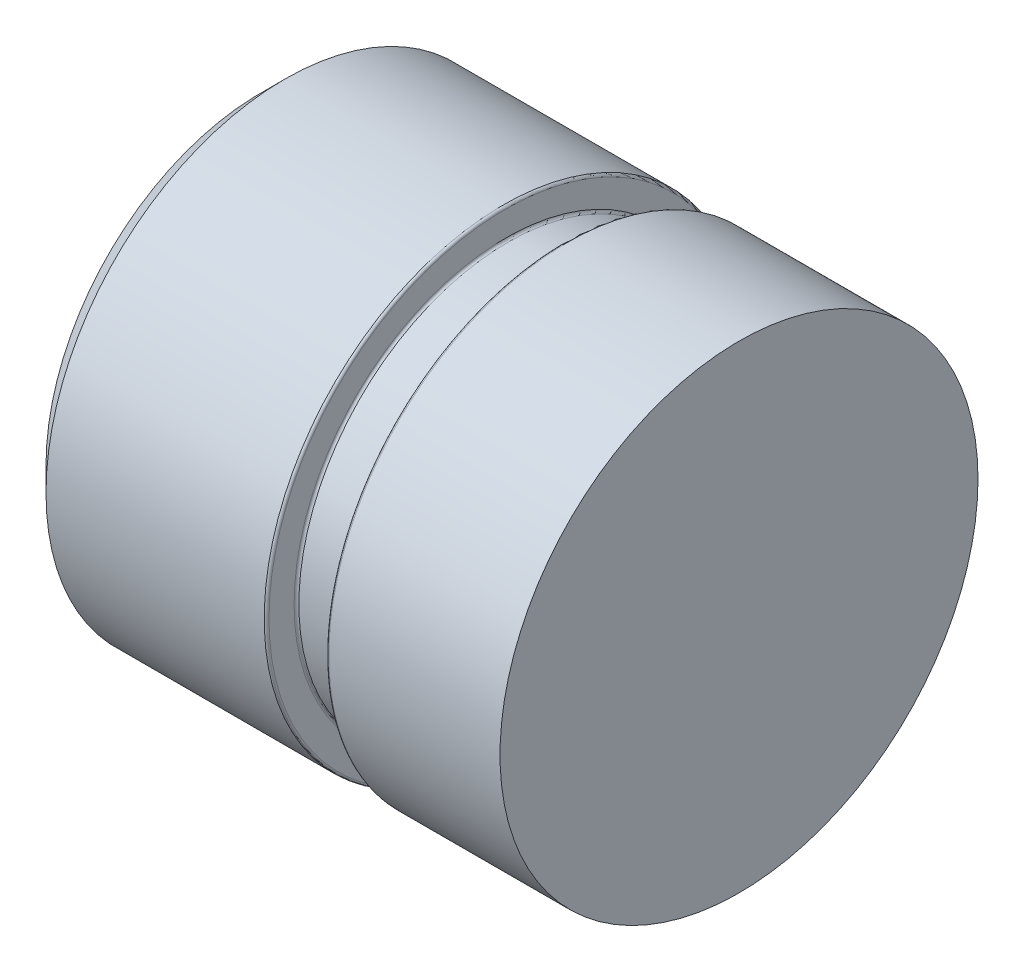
from build123d import *

# Parameters (mm, degrees)
CHAMFER1_SIZE = 2.54


with BuildPart() as part:
    # Sketch1 → Revolve1 (revolve)
    with BuildSketch(Plane.XY, mode=Mode.PRIVATE) as revolve1_sk:
        with BuildLine():
            Line((0, 0), (0, 25.4))
            Line((0, 25.4), (-18.203521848, 25.4))
            ThreePointArc((-18.203521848, 25.4), (-18.38312697, 25.325605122), (-18.457521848, 25.146))
            Line((-18.457521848, 25.146), (-18.457521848, 22.479))
            ThreePointArc((-18.457521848, 22.479), (-18.531916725, 22.299394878), (-18.711521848, 22.225))
            Line((-18.711521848, 22.225), (-24.553521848, 22.225))
            ThreePointArc((-24.553521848, 22.225), (-24.73312697, 22.299394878), (-24.807521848, 22.479))
            Line((-24.807521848, 22.479), (-24.807521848, 25.146))
            ThreePointArc((-24.807521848, 25.146), (-24.881916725, 25.325605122), (-25.061521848, 25.4))
            Line((-25.061521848, 25.4), (-50.793955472, 25.4))
            Line((-50.793955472, 25.4), (-50.793955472, 0))
            Line((-50.793955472, 0), (-0.858489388, 0))
            Line((-0.858489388, 0), (0, 0))
        make_face()
    revolve(revolve1_sk.sketch.rotate(Axis((15.882053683, 0, 0), (-1, 0, 0)), 90), axis=Axis((15.882053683, 0, 0), (-1, 0, 0)))

    # Chamfer1
    chamfer1_edges = [part.edges().sort_by_distance(p)[0] for p in [
        (-50.793955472, 0, 25.4),
    ]]
    chamfer(chamfer1_edges, length=CHAMFER1_SIZE)


solid = part.part
